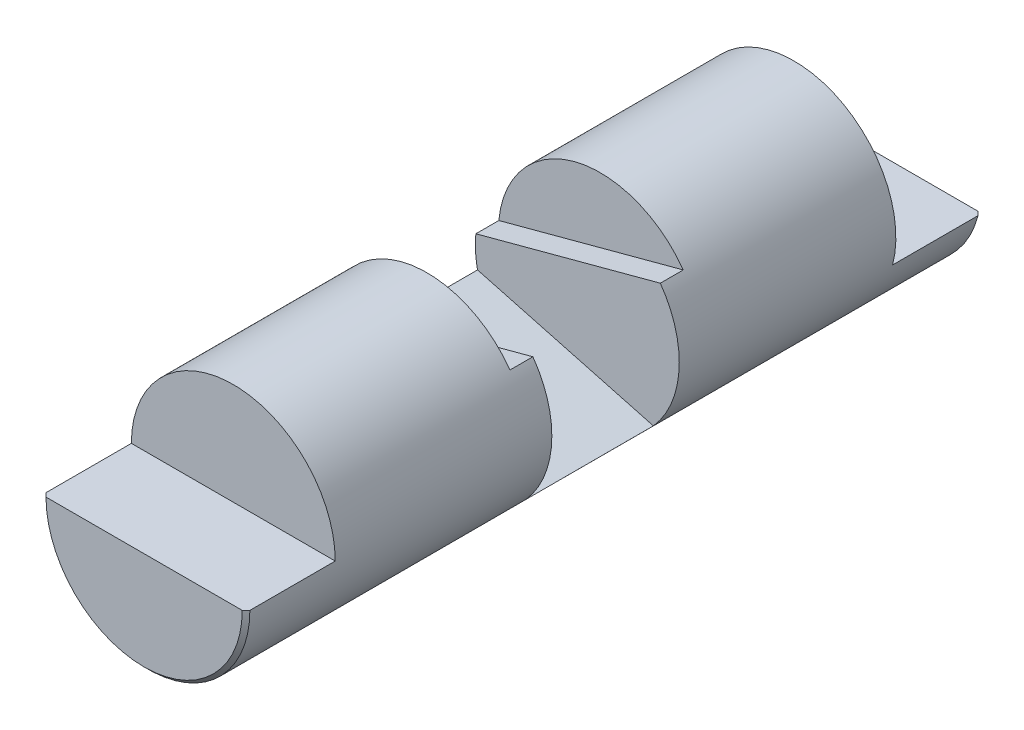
ISO-10303-21;
HEADER;
FILE_DESCRIPTION(('STEP AP214'),'2;1');
FILE_NAME('part.step','',(''),(''),'','','');
FILE_SCHEMA(('AUTOMOTIVE_DESIGN { 1 0 10303 214 1 1 1 1 }'));
ENDSEC;
DATA;
#1=APPLICATION_CONTEXT('core data for automotive mechanical design processes');
#2=APPLICATION_PROTOCOL_DEFINITION('international standard','automotive_design',2000,#1);
#3=PRODUCT_CONTEXT('',#1,'mechanical');
#4=PRODUCT('Part','Part','',(#3));
#5=PRODUCT_RELATED_PRODUCT_CATEGORY('part','',(#4));
#6=PRODUCT_DEFINITION_FORMATION('','',#4);
#7=PRODUCT_DEFINITION_CONTEXT('part definition',#1,'design');
#8=PRODUCT_DEFINITION('design','',#6,#7);
#9=PRODUCT_DEFINITION_SHAPE('','',#8);
#10=(LENGTH_UNIT() NAMED_UNIT(*) SI_UNIT(.MILLI.,.METRE.));
#11=(NAMED_UNIT(*) PLANE_ANGLE_UNIT() SI_UNIT($,.RADIAN.));
#12=(NAMED_UNIT(*) SI_UNIT($,.STERADIAN.) SOLID_ANGLE_UNIT());
#13=UNCERTAINTY_MEASURE_WITH_UNIT(LENGTH_MEASURE(1.E-05),#10,'distance_accuracy_value','');
#14=(GEOMETRIC_REPRESENTATION_CONTEXT(3) GLOBAL_UNCERTAINTY_ASSIGNED_CONTEXT((#13)) GLOBAL_UNIT_ASSIGNED_CONTEXT((#10,
#11,#12)) REPRESENTATION_CONTEXT('',''));
#15=CARTESIAN_POINT('',(0.,0.,0.));
#16=DIRECTION('',(0.,0.,1.));
#17=DIRECTION('',(1.,0.,0.));
#18=AXIS2_PLACEMENT_3D('',#15,#16,#17);
#19=CARTESIAN_POINT('',(0.,0.,14.5));
#20=DIRECTION('',(0.,0.,-1.));
#21=DIRECTION('',(-1.,0.,0.));
#22=AXIS2_PLACEMENT_3D('',#19,#20,#21);
#23=CYLINDRICAL_SURFACE('',#22,4.);
#24=CARTESIAN_POINT('',(0.,0.,14.35));
#25=DIRECTION('',(0.,0.,1.));
#26=DIRECTION('',(1.,0.,0.));
#27=AXIS2_PLACEMENT_3D('',#24,#25,#26);
#28=CIRCLE('',#27,4.);
#29=CARTESIAN_POINT('',(4.,0.,14.35));
#30=VERTEX_POINT('',#29);
#31=CARTESIAN_POINT('',(-4.,0.,14.35));
#32=VERTEX_POINT('',#31);
#33=EDGE_CURVE('E168',#30,#32,#28,.F.);
#34=ORIENTED_EDGE('',*,*,#33,.T.);
#35=DIRECTION('',(0.,0.,-1.));
#36=VECTOR('',#35,1.);
#37=CARTESIAN_POINT('',(-4.,0.,14.5));
#38=LINE('',#37,#36);
#39=CARTESIAN_POINT('',(-4.,0.,11.));
#40=VERTEX_POINT('',#39);
#41=EDGE_CURVE('E106',#32,#40,#38,.T.);
#42=ORIENTED_EDGE('',*,*,#41,.T.);
#43=CARTESIAN_POINT('',(0.,0.,11.));
#44=DIRECTION('',(0.,0.,1.));
#45=DIRECTION('',(1.,0.,0.));
#46=AXIS2_PLACEMENT_3D('',#43,#44,#45);
#47=CIRCLE('',#46,4.);
#48=CARTESIAN_POINT('',(4.,0.,11.));
#49=VERTEX_POINT('',#48);
#50=EDGE_CURVE('E11',#49,#40,#47,.T.);
#51=ORIENTED_EDGE('',*,*,#50,.F.);
#52=DIRECTION('',(0.,0.,-1.));
#53=VECTOR('',#52,1.);
#54=CARTESIAN_POINT('',(4.,0.,14.5));
#55=LINE('',#54,#53);
#56=EDGE_CURVE('E299',#49,#30,#55,.F.);
#57=ORIENTED_EDGE('',*,*,#56,.T.);
#58=EDGE_LOOP('',(#34,#42,#51,#57));
#59=FACE_BOUND('',#58,.T.);
#60=CARTESIAN_POINT('',(0.,0.,-2.5));
#61=DIRECTION('',(0.,0.,-1.));
#62=DIRECTION('',(0.,1.,0.));
#63=AXIS2_PLACEMENT_3D('',#60,#61,#62);
#64=CIRCLE('',#63,4.);
#65=CARTESIAN_POINT('',(-3.91627166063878,-0.814135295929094,-2.5));
#66=VERTEX_POINT('',#65);
#67=CARTESIAN_POINT('',(-3.98166957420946,0.382501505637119,-2.5));
#68=VERTEX_POINT('',#67);
#69=EDGE_CURVE('E173',#66,#68,#64,.T.);
#70=ORIENTED_EDGE('',*,*,#69,.T.);
#71=DIRECTION('',(0.,0.,-1.));
#72=VECTOR('',#71,1.);
#73=CARTESIAN_POINT('',(-3.98166957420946,0.382501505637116,14.5));
#74=LINE('',#73,#72);
#75=CARTESIAN_POINT('',(-3.98166957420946,0.382501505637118,-3.4));
#76=VERTEX_POINT('',#75);
#77=EDGE_CURVE('E312',#68,#76,#74,.T.);
#78=ORIENTED_EDGE('',*,*,#77,.T.);
#79=CARTESIAN_POINT('',(0.,0.,-3.4));
#80=DIRECTION('',(0.,0.,-1.));
#81=DIRECTION('',(-1.,0.,0.));
#82=AXIS2_PLACEMENT_3D('',#79,#80,#81);
#83=CIRCLE('',#82,4.);
#84=CARTESIAN_POINT('',(3.2569762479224,2.32209080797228,-3.4));
#85=VERTEX_POINT('',#84);
#86=EDGE_CURVE('E341',#76,#85,#83,.T.);
#87=ORIENTED_EDGE('',*,*,#86,.T.);
#88=DIRECTION('',(0.,0.,-1.));
#89=VECTOR('',#88,1.);
#90=CARTESIAN_POINT('',(3.2569762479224,2.32209080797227,14.5));
#91=LINE('',#90,#89);
#92=CARTESIAN_POINT('',(3.2569762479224,2.32209080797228,-2.5));
#93=VERTEX_POINT('',#92);
#94=EDGE_CURVE('E308',#85,#93,#91,.F.);
#95=ORIENTED_EDGE('',*,*,#94,.T.);
#96=CARTESIAN_POINT('',(2.9845230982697,-2.66319767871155,-2.5));
#97=VERTEX_POINT('',#96);
#98=EDGE_CURVE('E331',#93,#97,#64,.T.);
#99=ORIENTED_EDGE('',*,*,#98,.T.);
#100=DIRECTION('',(0.,0.,-1.));
#101=VECTOR('',#100,1.);
#102=CARTESIAN_POINT('',(2.9845230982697,-2.66319767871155,14.5));
#103=LINE('',#102,#101);
#104=CARTESIAN_POINT('',(2.9845230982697,-2.66319767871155,2.5));
#105=VERTEX_POINT('',#104);
#106=EDGE_CURVE('E184',#97,#105,#103,.F.);
#107=ORIENTED_EDGE('',*,*,#106,.T.);
#108=CARTESIAN_POINT('',(0.,0.,2.5));
#109=DIRECTION('',(0.,0.,1.));
#110=DIRECTION('',(0.,-1.,0.));
#111=AXIS2_PLACEMENT_3D('',#108,#109,#110);
#112=CIRCLE('',#111,4.);
#113=CARTESIAN_POINT('',(3.2569762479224,2.32209080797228,2.5));
#114=VERTEX_POINT('',#113);
#115=EDGE_CURVE('E327',#105,#114,#112,.T.);
#116=ORIENTED_EDGE('',*,*,#115,.T.);
#117=CARTESIAN_POINT('',(3.2569762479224,2.32209080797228,3.4));
#118=VERTEX_POINT('',#117);
#119=EDGE_CURVE('E39',#114,#118,#91,.F.);
#120=ORIENTED_EDGE('',*,*,#119,.T.);
#121=CARTESIAN_POINT('',(0.,0.,3.4));
#122=DIRECTION('',(0.,0.,1.));
#123=DIRECTION('',(0.,-1.,0.));
#124=AXIS2_PLACEMENT_3D('',#121,#122,#123);
#125=CIRCLE('',#124,4.);
#126=CARTESIAN_POINT('',(-3.98166957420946,0.382501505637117,3.4));
#127=VERTEX_POINT('',#126);
#128=EDGE_CURVE('E339',#118,#127,#125,.T.);
#129=ORIENTED_EDGE('',*,*,#128,.T.);
#130=CARTESIAN_POINT('',(-3.98166957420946,0.382501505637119,2.5));
#131=VERTEX_POINT('',#130);
#132=EDGE_CURVE('E315',#127,#131,#74,.T.);
#133=ORIENTED_EDGE('',*,*,#132,.T.);
#134=CARTESIAN_POINT('',(-3.91627166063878,-0.814135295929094,2.5));
#135=VERTEX_POINT('',#134);
#136=EDGE_CURVE('E328',#131,#135,#112,.T.);
#137=ORIENTED_EDGE('',*,*,#136,.T.);
#138=DIRECTION('',(0.,0.,-1.));
#139=VECTOR('',#138,1.);
#140=CARTESIAN_POINT('',(-3.91627166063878,-0.814135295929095,14.5));
#141=LINE('',#140,#139);
#142=EDGE_CURVE('E326',#135,#66,#141,.T.);
#143=ORIENTED_EDGE('',*,*,#142,.T.);
#144=EDGE_LOOP('',(#70,#78,#87,#95,#99,#107,#116,#120,#129,#133,#137,#143));
#145=FACE_BOUND('',#144,.T.);
#146=CARTESIAN_POINT('',(0.,0.,-11.));
#147=DIRECTION('',(0.,0.,1.));
#148=DIRECTION('',(0.,-1.,0.));
#149=AXIS2_PLACEMENT_3D('',#146,#147,#148);
#150=CIRCLE('',#149,4.);
#151=CARTESIAN_POINT('',(3.87298334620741,-1.,-11.));
#152=VERTEX_POINT('',#151);
#153=CARTESIAN_POINT('',(-3.87298334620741,-1.,-11.));
#154=VERTEX_POINT('',#153);
#155=EDGE_CURVE('E176',#152,#154,#150,.T.);
#156=ORIENTED_EDGE('',*,*,#155,.T.);
#157=DIRECTION('',(0.,0.,-1.));
#158=VECTOR('',#157,1.);
#159=CARTESIAN_POINT('',(-3.87298334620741,-1.,14.5));
#160=LINE('',#159,#158);
#161=CARTESIAN_POINT('',(-3.87298334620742,-1.,-14.35));
#162=VERTEX_POINT('',#161);
#163=EDGE_CURVE('E179',#154,#162,#160,.T.);
#164=ORIENTED_EDGE('',*,*,#163,.T.);
#165=CARTESIAN_POINT('',(0.,0.,-14.35));
#166=DIRECTION('',(0.,0.,1.));
#167=DIRECTION('',(1.,0.,0.));
#168=AXIS2_PLACEMENT_3D('',#165,#166,#167);
#169=CIRCLE('',#168,4.);
#170=CARTESIAN_POINT('',(3.87298334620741,-1.,-14.35));
#171=VERTEX_POINT('',#170);
#172=EDGE_CURVE('E125',#162,#171,#169,.T.);
#173=ORIENTED_EDGE('',*,*,#172,.T.);
#174=DIRECTION('',(0.,0.,-1.));
#175=VECTOR('',#174,1.);
#176=CARTESIAN_POINT('',(3.87298334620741,-1.,14.5));
#177=LINE('',#176,#175);
#178=EDGE_CURVE('E181',#171,#152,#177,.F.);
#179=ORIENTED_EDGE('',*,*,#178,.T.);
#180=EDGE_LOOP('',(#156,#164,#173,#179));
#181=FACE_BOUND('',#180,.T.);
#182=ADVANCED_FACE('F17',(#59,#145,#181),#23,.T.);
#183=CARTESIAN_POINT('',(0.,0.,14.5));
#184=DIRECTION('',(0.,0.,1.));
#185=DIRECTION('',(1.,0.,0.));
#186=AXIS2_PLACEMENT_3D('',#183,#184,#185);
#187=PLANE('',#186);
#188=DIRECTION('',(1.,0.,0.));
#189=VECTOR('',#188,1.);
#190=CARTESIAN_POINT('',(-5.,0.,14.5));
#191=LINE('',#190,#189);
#192=CARTESIAN_POINT('',(-3.85,0.,14.5));
#193=VERTEX_POINT('',#192);
#194=CARTESIAN_POINT('',(3.85,0.,14.5));
#195=VERTEX_POINT('',#194);
#196=EDGE_CURVE('E31',#193,#195,#191,.T.);
#197=ORIENTED_EDGE('',*,*,#196,.F.);
#198=CARTESIAN_POINT('',(0.,0.,14.5));
#199=DIRECTION('',(0.,0.,1.));
#200=DIRECTION('',(1.,0.,0.));
#201=AXIS2_PLACEMENT_3D('',#198,#199,#200);
#202=CIRCLE('',#201,3.85);
#203=EDGE_CURVE('E115',#193,#195,#202,.T.);
#204=ORIENTED_EDGE('',*,*,#203,.T.);
#205=EDGE_LOOP('',(#197,#204));
#206=FACE_BOUND('',#205,.T.);
#207=ADVANCED_FACE('F114',(#206),#187,.T.);
#208=CARTESIAN_POINT('',(0.,0.,-14.5));
#209=DIRECTION('',(0.,0.,1.));
#210=DIRECTION('',(1.,0.,0.));
#211=AXIS2_PLACEMENT_3D('',#208,#209,#210);
#212=PLANE('',#211);
#213=CARTESIAN_POINT('',(0.,0.,-14.5));
#214=DIRECTION('',(0.,0.,1.));
#215=DIRECTION('',(1.,0.,0.));
#216=AXIS2_PLACEMENT_3D('',#213,#214,#215);
#217=CIRCLE('',#216,3.85);
#218=CARTESIAN_POINT('',(3.71786228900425,-1.,-14.5));
#219=VERTEX_POINT('',#218);
#220=CARTESIAN_POINT('',(-3.71786228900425,-1.,-14.5));
#221=VERTEX_POINT('',#220);
#222=EDGE_CURVE('E120',#219,#221,#217,.F.);
#223=ORIENTED_EDGE('',*,*,#222,.T.);
#224=DIRECTION('',(1.,0.,0.));
#225=VECTOR('',#224,1.);
#226=CARTESIAN_POINT('',(0.,-1.,-14.5));
#227=LINE('',#226,#225);
#228=EDGE_CURVE('E188',#221,#219,#227,.T.);
#229=ORIENTED_EDGE('',*,*,#228,.T.);
#230=EDGE_LOOP('',(#223,#229));
#231=FACE_BOUND('',#230,.T.);
#232=ADVANCED_FACE('F159',(#231),#212,.F.);
#233=CARTESIAN_POINT('',(0.,0.,-14.35));
#234=DIRECTION('',(0.,0.,1.));
#235=DIRECTION('',(1.,0.,0.));
#236=AXIS2_PLACEMENT_3D('',#233,#234,#235);
#237=CONICAL_SURFACE('',#236,4.,0.785398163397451);
#238=CARTESIAN_POINT('',(-1.77135590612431,-1.,-16.3158658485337));
#239=CARTESIAN_POINT('',(-1.85170838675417,-1.,-16.2458534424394));
#240=CARTESIAN_POINT('',(-1.93152810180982,-1.,-16.1752369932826));
#241=CARTESIAN_POINT('',(-2.09032499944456,-1.,-16.0330704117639));
#242=CARTESIAN_POINT('',(-2.1693022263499,-1.,-15.9615203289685));
#243=CARTESIAN_POINT('',(-2.32663566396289,-1.,-15.8177624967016));
#244=CARTESIAN_POINT('',(-2.40499195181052,-1.,-15.745554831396));
#245=CARTESIAN_POINT('',(-2.5612309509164,-1.,-15.6006269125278));
#246=CARTESIAN_POINT('',(-2.63911365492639,-1.,-15.5279066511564));
#247=CARTESIAN_POINT('',(-2.87218649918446,-1.,-15.3091855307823));
#248=CARTESIAN_POINT('',(-3.02682771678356,-1.,-15.1626001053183));
#249=CARTESIAN_POINT('',(-3.33517328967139,-1.,-14.8684376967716));
#250=CARTESIAN_POINT('',(-3.48887760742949,-1.,-14.7208606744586));
#251=CARTESIAN_POINT('',(-3.90769539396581,-1.,-14.3170013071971));
#252=CARTESIAN_POINT('',(-4.17217317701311,-1.,-14.0600601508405));
#253=CARTESIAN_POINT('',(-4.7000525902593,-1.,-13.5450847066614));
#254=CARTESIAN_POINT('',(-4.96345423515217,-1.,-13.2870504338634));
#255=CARTESIAN_POINT('',(-5.48964291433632,-1.,-12.7702412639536));
#256=CARTESIAN_POINT('',(-5.75242980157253,-1.,-12.5114662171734));
#257=CARTESIAN_POINT('',(-6.27754092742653,-1.,-11.9934447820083));
#258=CARTESIAN_POINT('',(-6.53986516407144,-1.,-11.7341983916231));
#259=CARTESIAN_POINT('',(-6.80206186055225,-1.,-11.4748239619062));
#260=B_SPLINE_CURVE_WITH_KNOTS('',3,(#238,#239,#240,#241,#242,#243,#244,#245,#246,#247,#248,
#249,#250,#251,#252,#253,#254,#255,#256,#257,#258,#259),.UNSPECIFIED.,.F.,.F.,(4,2,2,2,2,2,2,2,
2,2,4),(0.,0.319715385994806,0.639413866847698,0.95907198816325,1.27873498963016,
1.91795361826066,2.5571976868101,3.66340275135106,4.76959266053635,5.87602455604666,
6.98246115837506),.UNSPECIFIED.);
#261=EDGE_CURVE('E122',#221,#162,#260,.T.);
#262=ORIENTED_EDGE('',*,*,#261,.F.);
#263=ORIENTED_EDGE('',*,*,#222,.F.);
#264=CARTESIAN_POINT('',(6.80206186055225,-1.,-11.4748239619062));
#265=CARTESIAN_POINT('',(6.53986516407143,-1.,-11.7341983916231));
#266=CARTESIAN_POINT('',(6.27754092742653,-1.,-11.9934447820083));
#267=CARTESIAN_POINT('',(5.75242980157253,-1.,-12.5114662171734));
#268=CARTESIAN_POINT('',(5.48964291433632,-1.,-12.7702412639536));
#269=CARTESIAN_POINT('',(4.96345423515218,-1.,-13.2870504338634));
#270=CARTESIAN_POINT('',(4.7000525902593,-1.,-13.5450847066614));
#271=CARTESIAN_POINT('',(4.17217317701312,-1.,-14.0600601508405));
#272=CARTESIAN_POINT('',(3.90769539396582,-1.,-14.3170013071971));
#273=CARTESIAN_POINT('',(3.4888776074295,-1.,-14.7208606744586));
#274=CARTESIAN_POINT('',(3.33517328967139,-1.,-14.8684376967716));
#275=CARTESIAN_POINT('',(3.02682771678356,-1.,-15.1626001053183));
#276=CARTESIAN_POINT('',(2.87218649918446,-1.,-15.3091855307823));
#277=CARTESIAN_POINT('',(2.6391136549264,-1.,-15.5279066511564));
#278=CARTESIAN_POINT('',(2.5612309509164,-1.,-15.6006269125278));
#279=CARTESIAN_POINT('',(2.40499195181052,-1.,-15.745554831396));
#280=CARTESIAN_POINT('',(2.32663566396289,-1.,-15.8177624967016));
#281=CARTESIAN_POINT('',(2.1693022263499,-1.,-15.9615203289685));
#282=CARTESIAN_POINT('',(2.09032499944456,-1.,-16.0330704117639));
#283=CARTESIAN_POINT('',(1.93152810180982,-1.,-16.1752369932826));
#284=CARTESIAN_POINT('',(1.85170838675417,-1.,-16.2458534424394));
#285=CARTESIAN_POINT('',(1.77135590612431,-1.,-16.3158658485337));
#286=B_SPLINE_CURVE_WITH_KNOTS('',3,(#264,#265,#266,#267,#268,#269,#270,#271,#272,#273,#274,
#275,#276,#277,#278,#279,#280,#281,#282,#283,#284,#285),.UNSPECIFIED.,.F.,.F.,(4,2,2,2,2,2,2,2,
2,2,4),(0.,1.1064366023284,2.21286849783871,3.319058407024,4.42526347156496,5.0645075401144,
5.7037261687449,6.02338917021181,6.34304729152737,6.66274577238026,6.98246115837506),.UNSPECIFIED.);
#287=EDGE_CURVE('E119',#171,#219,#286,.T.);
#288=ORIENTED_EDGE('',*,*,#287,.F.);
#289=ORIENTED_EDGE('',*,*,#172,.F.);
#290=EDGE_LOOP('',(#262,#263,#288,#289));
#291=FACE_BOUND('',#290,.T.);
#292=ADVANCED_FACE('F138',(#291),#237,.T.);
#293=CARTESIAN_POINT('',(0.,0.,14.5));
#294=DIRECTION('',(0.,0.,-1.));
#295=DIRECTION('',(-1.,0.,0.));
#296=AXIS2_PLACEMENT_3D('',#293,#294,#295);
#297=CONICAL_SURFACE('',#296,3.85,0.785398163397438);
#298=DIRECTION('',(-0.70710678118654,0.,-0.707106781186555));
#299=VECTOR('',#298,1.);
#300=CARTESIAN_POINT('',(0.,0.,18.35));
#301=LINE('',#300,#299);
#302=EDGE_CURVE('E24',#32,#193,#301,.F.);
#303=ORIENTED_EDGE('',*,*,#302,.F.);
#304=ORIENTED_EDGE('',*,*,#33,.F.);
#305=DIRECTION('',(-0.70710678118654,0.,0.707106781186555));
#306=VECTOR('',#305,1.);
#307=CARTESIAN_POINT('',(0.,0.,18.35));
#308=LINE('',#307,#306);
#309=EDGE_CURVE('E111',#195,#30,#308,.F.);
#310=ORIENTED_EDGE('',*,*,#309,.F.);
#311=ORIENTED_EDGE('',*,*,#203,.F.);
#312=EDGE_LOOP('',(#303,#304,#310,#311));
#313=FACE_BOUND('',#312,.T.);
#314=ADVANCED_FACE('F118',(#313),#297,.T.);
#315=CARTESIAN_POINT('',(-4.,7.,-11.));
#316=DIRECTION('',(0.,0.,1.));
#317=DIRECTION('',(0.,-1.,0.));
#318=AXIS2_PLACEMENT_3D('',#315,#316,#317);
#319=PLANE('',#318);
#320=DIRECTION('',(1.,0.,0.));
#321=VECTOR('',#320,1.);
#322=CARTESIAN_POINT('',(-4.,-1.,-11.));
#323=LINE('',#322,#321);
#324=EDGE_CURVE('E185',#154,#152,#323,.T.);
#325=ORIENTED_EDGE('',*,*,#324,.F.);
#326=ORIENTED_EDGE('',*,*,#155,.F.);
#327=EDGE_LOOP('',(#325,#326));
#328=FACE_BOUND('',#327,.T.);
#329=ADVANCED_FACE('F148',(#328),#319,.F.);
#330=CARTESIAN_POINT('',(-4.,-1.,-11.));
#331=DIRECTION('',(0.,-1.,0.));
#332=DIRECTION('',(0.,0.,-1.));
#333=AXIS2_PLACEMENT_3D('',#330,#331,#332);
#334=PLANE('',#333);
#335=ORIENTED_EDGE('',*,*,#324,.T.);
#336=ORIENTED_EDGE('',*,*,#178,.F.);
#337=ORIENTED_EDGE('',*,*,#287,.T.);
#338=ORIENTED_EDGE('',*,*,#228,.F.);
#339=ORIENTED_EDGE('',*,*,#261,.T.);
#340=ORIENTED_EDGE('',*,*,#163,.F.);
#341=EDGE_LOOP('',(#335,#336,#337,#338,#339,#340));
#342=FACE_BOUND('',#341,.T.);
#343=ADVANCED_FACE('F142',(#342),#334,.F.);
#344=CARTESIAN_POINT('',(-2.6097346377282,9.18854096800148,2.5));
#345=DIRECTION('',(0.,0.,1.));
#346=DIRECTION('',(0.,-1.,0.));
#347=AXIS2_PLACEMENT_3D('',#344,#345,#346);
#348=PLANE('',#347);
#349=ORIENTED_EDGE('',*,*,#136,.F.);
#350=DIRECTION('',(0.965925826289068,0.258819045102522,0.));
#351=VECTOR('',#350,1.);
#352=CARTESIAN_POINT('',(-0.500126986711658,1.31537803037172,2.5));
#353=LINE('',#352,#351);
#354=EDGE_CURVE('E314',#131,#114,#353,.T.);
#355=ORIENTED_EDGE('',*,*,#354,.T.);
#356=ORIENTED_EDGE('',*,*,#115,.F.);
#357=DIRECTION('',(0.965925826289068,-0.258819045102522,0.));
#358=VECTOR('',#357,1.);
#359=CARTESIAN_POINT('',(-5.19792508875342,-0.470717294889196,2.5));
#360=LINE('',#359,#358);
#361=EDGE_CURVE('E194',#135,#105,#360,.T.);
#362=ORIENTED_EDGE('',*,*,#361,.F.);
#363=EDGE_LOOP('',(#349,#355,#356,#362));
#364=FACE_BOUND('',#363,.T.);
#365=ADVANCED_FACE('F147',(#364),#348,.F.);
#366=CARTESIAN_POINT('',(-2.6097346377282,9.18854096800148,-2.5));
#367=DIRECTION('',(0.,0.,-1.));
#368=DIRECTION('',(0.,1.,0.));
#369=AXIS2_PLACEMENT_3D('',#366,#367,#368);
#370=PLANE('',#369);
#371=ORIENTED_EDGE('',*,*,#98,.F.);
#372=DIRECTION('',(-0.965925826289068,-0.258819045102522,0.));
#373=VECTOR('',#372,1.);
#374=CARTESIAN_POINT('',(-0.500126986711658,1.31537803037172,-2.5));
#375=LINE('',#374,#373);
#376=EDGE_CURVE('E336',#93,#68,#375,.T.);
#377=ORIENTED_EDGE('',*,*,#376,.T.);
#378=ORIENTED_EDGE('',*,*,#69,.F.);
#379=DIRECTION('',(0.965925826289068,-0.258819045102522,0.));
#380=VECTOR('',#379,1.);
#381=CARTESIAN_POINT('',(-5.19792508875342,-0.470717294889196,-2.5));
#382=LINE('',#381,#380);
#383=EDGE_CURVE('E189',#66,#97,#382,.T.);
#384=ORIENTED_EDGE('',*,*,#383,.T.);
#385=EDGE_LOOP('',(#371,#377,#378,#384));
#386=FACE_BOUND('',#385,.T.);
#387=ADVANCED_FACE('F236',(#386),#370,.F.);
#388=CARTESIAN_POINT('',(-5.19792508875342,-0.470717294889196,2.5));
#389=DIRECTION('',(-0.258819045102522,-0.965925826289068,0.));
#390=DIRECTION('',(0.965925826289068,-0.258819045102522,0.));
#391=AXIS2_PLACEMENT_3D('',#388,#389,#390);
#392=PLANE('',#391);
#393=ORIENTED_EDGE('',*,*,#361,.T.);
#394=ORIENTED_EDGE('',*,*,#106,.F.);
#395=ORIENTED_EDGE('',*,*,#383,.F.);
#396=ORIENTED_EDGE('',*,*,#142,.F.);
#397=EDGE_LOOP('',(#393,#394,#395,#396));
#398=FACE_BOUND('',#397,.T.);
#399=ADVANCED_FACE('F243',(#398),#392,.F.);
#400=CARTESIAN_POINT('',(-5.09439747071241,0.0843469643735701,3.4));
#401=DIRECTION('',(0.258819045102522,-0.965925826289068,0.));
#402=DIRECTION('',(0.965925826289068,0.258819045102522,0.));
#403=AXIS2_PLACEMENT_3D('',#400,#401,#402);
#404=PLANE('',#403);
#405=ORIENTED_EDGE('',*,*,#376,.F.);
#406=ORIENTED_EDGE('',*,*,#94,.F.);
#407=DIRECTION('',(0.965925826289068,0.258819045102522,0.));
#408=VECTOR('',#407,1.);
#409=CARTESIAN_POINT('',(-5.09439747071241,0.0843469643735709,-3.4));
#410=LINE('',#409,#408);
#411=EDGE_CURVE('E303',#76,#85,#410,.T.);
#412=ORIENTED_EDGE('',*,*,#411,.F.);
#413=ORIENTED_EDGE('',*,*,#77,.F.);
#414=EDGE_LOOP('',(#405,#406,#412,#413));
#415=FACE_BOUND('',#414,.T.);
#416=ADVANCED_FACE('F251',(#415),#404,.F.);
#417=CARTESIAN_POINT('',(-7.16494983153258,7.81175357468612,-3.4));
#418=DIRECTION('',(0.,0.,-1.));
#419=DIRECTION('',(-1.,0.,0.));
#420=AXIS2_PLACEMENT_3D('',#417,#418,#419);
#421=PLANE('',#420);
#422=ORIENTED_EDGE('',*,*,#411,.T.);
#423=ORIENTED_EDGE('',*,*,#86,.F.);
#424=EDGE_LOOP('',(#422,#423));
#425=FACE_BOUND('',#424,.T.);
#426=ADVANCED_FACE('F258',(#425),#421,.F.);
#427=CARTESIAN_POINT('',(-7.16494983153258,7.81175357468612,3.4));
#428=DIRECTION('',(0.,0.,1.));
#429=DIRECTION('',(0.,-1.,0.));
#430=AXIS2_PLACEMENT_3D('',#427,#428,#429);
#431=PLANE('',#430);
#432=DIRECTION('',(0.965925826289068,0.258819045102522,0.));
#433=VECTOR('',#432,1.);
#434=CARTESIAN_POINT('',(-5.09439747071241,0.0843469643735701,3.4));
#435=LINE('',#434,#433);
#436=EDGE_CURVE('E301',#127,#118,#435,.T.);
#437=ORIENTED_EDGE('',*,*,#436,.F.);
#438=ORIENTED_EDGE('',*,*,#128,.F.);
#439=EDGE_LOOP('',(#437,#438));
#440=FACE_BOUND('',#439,.T.);
#441=ADVANCED_FACE('F267',(#440),#431,.F.);
#442=ORIENTED_EDGE('',*,*,#436,.T.);
#443=ORIENTED_EDGE('',*,*,#119,.F.);
#444=ORIENTED_EDGE('',*,*,#354,.F.);
#445=ORIENTED_EDGE('',*,*,#132,.F.);
#446=EDGE_LOOP('',(#442,#443,#444,#445));
#447=FACE_BOUND('',#446,.T.);
#448=ADVANCED_FACE('F261',(#447),#404,.F.);
#449=CARTESIAN_POINT('',(0.,0.,11.));
#450=DIRECTION('',(0.,0.,1.));
#451=DIRECTION('',(1.,0.,0.));
#452=AXIS2_PLACEMENT_3D('',#449,#450,#451);
#453=PLANE('',#452);
#454=ORIENTED_EDGE('',*,*,#50,.T.);
#455=DIRECTION('',(1.,0.,0.));
#456=VECTOR('',#455,1.);
#457=CARTESIAN_POINT('',(-5.,0.,11.));
#458=LINE('',#457,#456);
#459=EDGE_CURVE('E116',#40,#49,#458,.T.);
#460=ORIENTED_EDGE('',*,*,#459,.T.);
#461=EDGE_LOOP('',(#454,#460));
#462=FACE_BOUND('',#461,.T.);
#463=ADVANCED_FACE('F282',(#462),#453,.T.);
#464=CARTESIAN_POINT('',(-5.,0.,11.));
#465=DIRECTION('',(0.,-1.,0.));
#466=DIRECTION('',(0.,0.,-1.));
#467=AXIS2_PLACEMENT_3D('',#464,#465,#466);
#468=PLANE('',#467);
#469=ORIENTED_EDGE('',*,*,#302,.T.);
#470=ORIENTED_EDGE('',*,*,#196,.T.);
#471=ORIENTED_EDGE('',*,*,#309,.T.);
#472=ORIENTED_EDGE('',*,*,#56,.F.);
#473=ORIENTED_EDGE('',*,*,#459,.F.);
#474=ORIENTED_EDGE('',*,*,#41,.F.);
#475=EDGE_LOOP('',(#469,#470,#471,#472,#473,#474));
#476=FACE_BOUND('',#475,.T.);
#477=ADVANCED_FACE('F103',(#476),#468,.F.);
#478=CLOSED_SHELL('',(#182,#207,#232,#292,#314,#329,#343,#365,#387,#399,#416,#426,#441,#448,
#463,#477));
#479=MANIFOLD_SOLID_BREP('B1',#478);
#480=ADVANCED_BREP_SHAPE_REPRESENTATION('',(#18,#479),#14);
#481=SHAPE_DEFINITION_REPRESENTATION(#9,#480);
ENDSEC;
END-ISO-10303-21;
